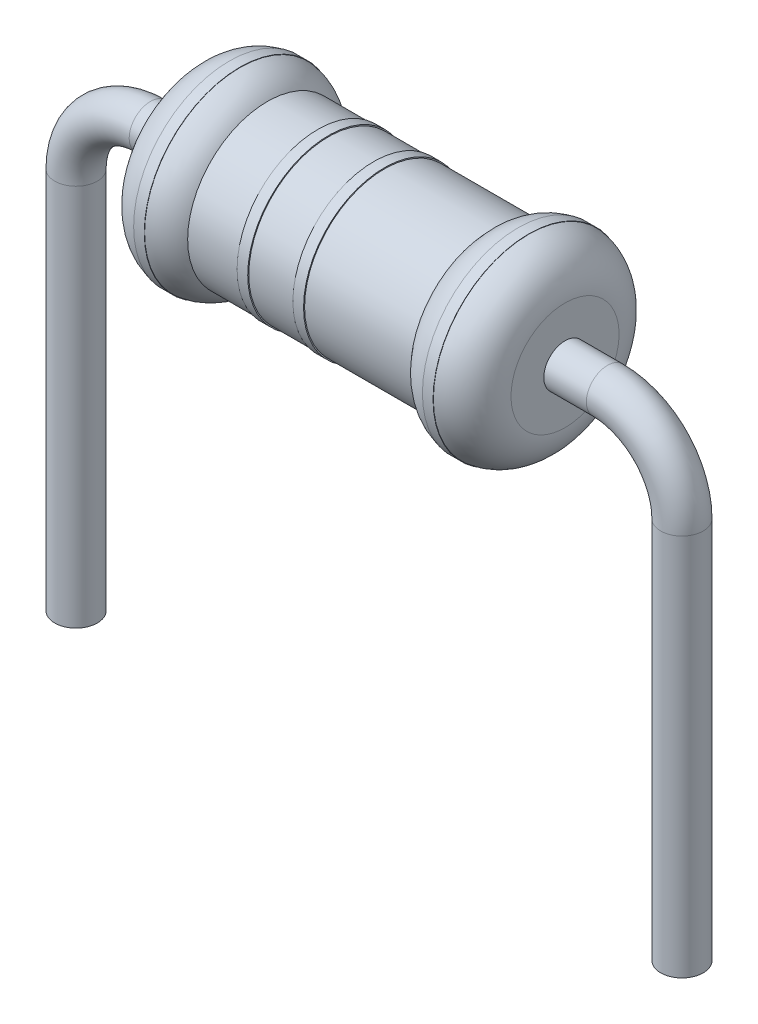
ISO-10303-21;
HEADER;
FILE_DESCRIPTION(('STEP AP214'),'2;1');
FILE_NAME('part.step','',(''),(''),'','','');
FILE_SCHEMA(('AUTOMOTIVE_DESIGN { 1 0 10303 214 1 1 1 1 }'));
ENDSEC;
DATA;
#1=APPLICATION_CONTEXT('core data for automotive mechanical design processes');
#2=APPLICATION_PROTOCOL_DEFINITION('international standard','automotive_design',2000,#1);
#3=PRODUCT_CONTEXT('',#1,'mechanical');
#4=PRODUCT('Part','Part','',(#3));
#5=PRODUCT_RELATED_PRODUCT_CATEGORY('part','',(#4));
#6=PRODUCT_DEFINITION_FORMATION('','',#4);
#7=PRODUCT_DEFINITION_CONTEXT('part definition',#1,'design');
#8=PRODUCT_DEFINITION('design','',#6,#7);
#9=PRODUCT_DEFINITION_SHAPE('','',#8);
#10=(LENGTH_UNIT() NAMED_UNIT(*) SI_UNIT(.MILLI.,.METRE.));
#11=(NAMED_UNIT(*) PLANE_ANGLE_UNIT() SI_UNIT($,.RADIAN.));
#12=(NAMED_UNIT(*) SI_UNIT($,.STERADIAN.) SOLID_ANGLE_UNIT());
#13=UNCERTAINTY_MEASURE_WITH_UNIT(LENGTH_MEASURE(1.E-05),#10,'distance_accuracy_value','');
#14=(GEOMETRIC_REPRESENTATION_CONTEXT(3) GLOBAL_UNCERTAINTY_ASSIGNED_CONTEXT((#13)) GLOBAL_UNIT_ASSIGNED_CONTEXT((#10,
#11,#12)) REPRESENTATION_CONTEXT('',''));
#15=CARTESIAN_POINT('',(0.,0.,0.));
#16=DIRECTION('',(0.,0.,1.));
#17=DIRECTION('',(1.,0.,0.));
#18=AXIS2_PLACEMENT_3D('',#15,#16,#17);
#19=CARTESIAN_POINT('',(1.75000000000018,0.,0.));
#20=DIRECTION('',(-1.,0.,0.));
#21=DIRECTION('',(0.,0.,1.));
#22=AXIS2_PLACEMENT_3D('',#19,#20,#21);
#23=PLANE('',#22);
#24=CARTESIAN_POINT('',(1.75000000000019,0.,0.));
#25=DIRECTION('',(-1.,0.,0.));
#26=DIRECTION('',(0.,0.,1.));
#27=AXIS2_PLACEMENT_3D('',#24,#25,#26);
#28=CIRCLE('',#27,0.508257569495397);
#29=CARTESIAN_POINT('',(1.75000000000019,0.,0.508257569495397));
#30=VERTEX_POINT('',#29);
#31=EDGE_CURVE('E37',#30,#30,#28,.T.);
#32=ORIENTED_EDGE('',*,*,#31,.F.);
#33=EDGE_LOOP('',(#32));
#34=FACE_BOUND('',#33,.T.);
#35=CARTESIAN_POINT('',(1.75000000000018,0.,0.));
#36=DIRECTION('',(-1.,0.,0.));
#37=DIRECTION('',(0.,0.,1.));
#38=AXIS2_PLACEMENT_3D('',#35,#36,#37);
#39=CIRCLE('',#38,0.2);
#40=CARTESIAN_POINT('',(1.75000000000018,0.,0.200000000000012));
#41=VERTEX_POINT('',#40);
#42=EDGE_CURVE('E10',#41,#41,#39,.F.);
#43=ORIENTED_EDGE('',*,*,#42,.F.);
#44=EDGE_LOOP('',(#43));
#45=FACE_BOUND('',#44,.T.);
#46=ADVANCED_FACE('F26',(#34,#45),#23,.F.);
#47=CARTESIAN_POINT('',(-1.75000000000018,0.,0.));
#48=DIRECTION('',(1.,0.,0.));
#49=DIRECTION('',(0.,0.,-1.));
#50=AXIS2_PLACEMENT_3D('',#47,#48,#49);
#51=PLANE('',#50);
#52=CARTESIAN_POINT('',(-1.75000000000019,0.,0.));
#53=DIRECTION('',(-1.,0.,0.));
#54=DIRECTION('',(0.,0.,1.));
#55=AXIS2_PLACEMENT_3D('',#52,#53,#54);
#56=CIRCLE('',#55,0.508257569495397);
#57=CARTESIAN_POINT('',(-1.75000000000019,0.,0.508257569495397));
#58=VERTEX_POINT('',#57);
#59=EDGE_CURVE('E56',#58,#58,#56,.T.);
#60=ORIENTED_EDGE('',*,*,#59,.T.);
#61=EDGE_LOOP('',(#60));
#62=FACE_BOUND('',#61,.T.);
#63=CARTESIAN_POINT('',(-1.75000000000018,0.,0.));
#64=DIRECTION('',(-1.,0.,0.));
#65=DIRECTION('',(0.,0.,1.));
#66=AXIS2_PLACEMENT_3D('',#63,#64,#65);
#67=CIRCLE('',#66,0.2);
#68=CARTESIAN_POINT('',(-1.75000000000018,0.,0.2));
#69=VERTEX_POINT('',#68);
#70=EDGE_CURVE('E33',#69,#69,#67,.T.);
#71=ORIENTED_EDGE('',*,*,#70,.F.);
#72=EDGE_LOOP('',(#71));
#73=FACE_BOUND('',#72,.T.);
#74=ADVANCED_FACE('F28',(#62,#73),#51,.F.);
#75=CARTESIAN_POINT('',(1.35825756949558,0.,0.));
#76=DIRECTION('',(-1.,0.,0.));
#77=DIRECTION('',(0.,0.,1.));
#78=AXIS2_PLACEMENT_3D('',#75,#76,#77);
#79=TOROIDAL_SURFACE('',#78,0.508257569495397,0.391742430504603);
#80=CARTESIAN_POINT('',(1.40825756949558,0.,0.));
#81=DIRECTION('',(-1.,0.,0.));
#82=DIRECTION('',(0.,0.,1.));
#83=AXIS2_PLACEMENT_3D('',#80,#81,#82);
#84=CIRCLE('',#83,0.896796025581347);
#85=CARTESIAN_POINT('',(1.40825756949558,0.,0.896796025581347));
#86=VERTEX_POINT('',#85);
#87=EDGE_CURVE('E42',#86,#86,#84,.T.);
#88=ORIENTED_EDGE('',*,*,#87,.F.);
#89=EDGE_LOOP('',(#88));
#90=FACE_BOUND('',#89,.T.);
#91=ORIENTED_EDGE('',*,*,#31,.T.);
#92=EDGE_LOOP('',(#91));
#93=FACE_BOUND('',#92,.T.);
#94=ADVANCED_FACE('F115',(#90,#93),#79,.T.);
#95=CARTESIAN_POINT('',(1.40825756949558,0.896796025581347,0.));
#96=DIRECTION('',(-1.,0.,0.));
#97=DIRECTION('',(0.,0.,1.));
#98=AXIS2_PLACEMENT_3D('',#95,#96,#97);
#99=PLANE('',#98);
#100=CARTESIAN_POINT('',(1.40825756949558,0.,0.));
#101=DIRECTION('',(-1.,0.,0.));
#102=DIRECTION('',(0.,0.,1.));
#103=AXIS2_PLACEMENT_3D('',#100,#101,#102);
#104=CIRCLE('',#103,0.900000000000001);
#105=CARTESIAN_POINT('',(1.40825756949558,0.,0.900000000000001));
#106=VERTEX_POINT('',#105);
#107=EDGE_CURVE('E107',#106,#106,#104,.T.);
#108=ORIENTED_EDGE('',*,*,#107,.F.);
#109=EDGE_LOOP('',(#108));
#110=FACE_BOUND('',#109,.T.);
#111=ORIENTED_EDGE('',*,*,#87,.T.);
#112=EDGE_LOOP('',(#111));
#113=FACE_BOUND('',#112,.T.);
#114=ADVANCED_FACE('F113',(#110,#113),#99,.F.);
#115=CARTESIAN_POINT('',(-9.42004899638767,0.,0.));
#116=DIRECTION('',(-1.,0.,0.));
#117=DIRECTION('',(0.,0.,1.));
#118=AXIS2_PLACEMENT_3D('',#115,#116,#117);
#119=CYLINDRICAL_SURFACE('',#118,0.900000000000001);
#120=CARTESIAN_POINT('',(1.30825756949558,0.,0.));
#121=DIRECTION('',(-1.,0.,0.));
#122=DIRECTION('',(0.,0.,1.));
#123=AXIS2_PLACEMENT_3D('',#120,#121,#122);
#124=CIRCLE('',#123,0.900000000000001);
#125=CARTESIAN_POINT('',(1.30825756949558,0.,0.900000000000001));
#126=VERTEX_POINT('',#125);
#127=EDGE_CURVE('E104',#126,#126,#124,.T.);
#128=ORIENTED_EDGE('',*,*,#127,.F.);
#129=EDGE_LOOP('',(#128));
#130=FACE_BOUND('',#129,.T.);
#131=ORIENTED_EDGE('',*,*,#107,.T.);
#132=EDGE_LOOP('',(#131));
#133=FACE_BOUND('',#132,.T.);
#134=ADVANCED_FACE('F132',(#130,#133),#119,.T.);
#135=CARTESIAN_POINT('',(1.30825756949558,0.896796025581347,0.));
#136=DIRECTION('',(1.,0.,0.));
#137=DIRECTION('',(0.,0.,-1.));
#138=AXIS2_PLACEMENT_3D('',#135,#136,#137);
#139=PLANE('',#138);
#140=CARTESIAN_POINT('',(1.30825756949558,0.,0.));
#141=DIRECTION('',(-1.,0.,0.));
#142=DIRECTION('',(0.,0.,1.));
#143=AXIS2_PLACEMENT_3D('',#140,#141,#142);
#144=CIRCLE('',#143,0.896796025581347);
#145=CARTESIAN_POINT('',(1.30825756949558,0.,0.896796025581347));
#146=VERTEX_POINT('',#145);
#147=EDGE_CURVE('E101',#146,#146,#144,.T.);
#148=ORIENTED_EDGE('',*,*,#147,.F.);
#149=EDGE_LOOP('',(#148));
#150=FACE_BOUND('',#149,.T.);
#151=ORIENTED_EDGE('',*,*,#127,.T.);
#152=EDGE_LOOP('',(#151));
#153=FACE_BOUND('',#152,.T.);
#154=ADVANCED_FACE('F136',(#150,#153),#139,.F.);
#155=CARTESIAN_POINT('',(1.35825756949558,0.,0.));
#156=DIRECTION('',(-1.,0.,0.));
#157=DIRECTION('',(0.,0.,1.));
#158=AXIS2_PLACEMENT_3D('',#155,#156,#157);
#159=TOROIDAL_SURFACE('',#158,0.508257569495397,0.391742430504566);
#160=CARTESIAN_POINT('',(1.04999999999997,0.,0.));
#161=DIRECTION('',(-1.,0.,0.));
#162=DIRECTION('',(0.,0.,1.));
#163=AXIS2_PLACEMENT_3D('',#160,#161,#162);
#164=CIRCLE('',#163,0.750000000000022);
#165=CARTESIAN_POINT('',(1.04999999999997,0.,0.750000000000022));
#166=VERTEX_POINT('',#165);
#167=EDGE_CURVE('E98',#166,#166,#164,.T.);
#168=ORIENTED_EDGE('',*,*,#167,.F.);
#169=EDGE_LOOP('',(#168));
#170=FACE_BOUND('',#169,.T.);
#171=ORIENTED_EDGE('',*,*,#147,.T.);
#172=EDGE_LOOP('',(#171));
#173=FACE_BOUND('',#172,.T.);
#174=ADVANCED_FACE('F140',(#170,#173),#159,.T.);
#175=CARTESIAN_POINT('',(-9.42004899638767,0.,0.));
#176=DIRECTION('',(-1.,0.,0.));
#177=DIRECTION('',(0.,0.,1.));
#178=AXIS2_PLACEMENT_3D('',#175,#176,#177);
#179=CYLINDRICAL_SURFACE('',#178,0.750000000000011);
#180=CARTESIAN_POINT('',(0.0499999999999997,0.,0.));
#181=DIRECTION('',(-1.,0.,0.));
#182=DIRECTION('',(0.,0.,1.));
#183=AXIS2_PLACEMENT_3D('',#180,#181,#182);
#184=CIRCLE('',#183,0.75);
#185=CARTESIAN_POINT('',(0.0499999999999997,0.,0.75));
#186=VERTEX_POINT('',#185);
#187=EDGE_CURVE('E95',#186,#186,#184,.T.);
#188=ORIENTED_EDGE('',*,*,#187,.F.);
#189=EDGE_LOOP('',(#188));
#190=FACE_BOUND('',#189,.T.);
#191=ORIENTED_EDGE('',*,*,#167,.T.);
#192=EDGE_LOOP('',(#191));
#193=FACE_BOUND('',#192,.T.);
#194=ADVANCED_FACE('F144',(#190,#193),#179,.T.);
#195=CARTESIAN_POINT('',(0.05,0.75,0.));
#196=DIRECTION('',(-1.,0.,0.));
#197=DIRECTION('',(0.,0.,1.));
#198=AXIS2_PLACEMENT_3D('',#195,#196,#197);
#199=PLANE('',#198);
#200=CARTESIAN_POINT('',(0.0499999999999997,0.,0.));
#201=DIRECTION('',(-1.,0.,0.));
#202=DIRECTION('',(0.,0.,1.));
#203=AXIS2_PLACEMENT_3D('',#200,#201,#202);
#204=CIRCLE('',#203,0.760000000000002);
#205=CARTESIAN_POINT('',(0.0499999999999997,0.,0.760000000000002));
#206=VERTEX_POINT('',#205);
#207=EDGE_CURVE('E92',#206,#206,#204,.T.);
#208=ORIENTED_EDGE('',*,*,#207,.F.);
#209=EDGE_LOOP('',(#208));
#210=FACE_BOUND('',#209,.T.);
#211=ORIENTED_EDGE('',*,*,#187,.T.);
#212=EDGE_LOOP('',(#211));
#213=FACE_BOUND('',#212,.T.);
#214=ADVANCED_FACE('F148',(#210,#213),#199,.F.);
#215=CARTESIAN_POINT('',(-9.42004899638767,0.,0.));
#216=DIRECTION('',(-1.,0.,0.));
#217=DIRECTION('',(0.,0.,1.));
#218=AXIS2_PLACEMENT_3D('',#215,#216,#217);
#219=CYLINDRICAL_SURFACE('',#218,0.760000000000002);
#220=CARTESIAN_POINT('',(-0.0499999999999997,0.,0.));
#221=DIRECTION('',(-1.,0.,0.));
#222=DIRECTION('',(0.,0.,1.));
#223=AXIS2_PLACEMENT_3D('',#220,#221,#222);
#224=CIRCLE('',#223,0.760000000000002);
#225=CARTESIAN_POINT('',(-0.0499999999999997,0.,0.760000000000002));
#226=VERTEX_POINT('',#225);
#227=EDGE_CURVE('E89',#226,#226,#224,.T.);
#228=ORIENTED_EDGE('',*,*,#227,.F.);
#229=EDGE_LOOP('',(#228));
#230=FACE_BOUND('',#229,.T.);
#231=ORIENTED_EDGE('',*,*,#207,.T.);
#232=EDGE_LOOP('',(#231));
#233=FACE_BOUND('',#232,.T.);
#234=ADVANCED_FACE('F152',(#230,#233),#219,.T.);
#235=CARTESIAN_POINT('',(-0.05,0.75,0.));
#236=DIRECTION('',(1.,0.,0.));
#237=DIRECTION('',(0.,0.,-1.));
#238=AXIS2_PLACEMENT_3D('',#235,#236,#237);
#239=PLANE('',#238);
#240=CARTESIAN_POINT('',(-0.0499999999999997,0.,0.));
#241=DIRECTION('',(-1.,0.,0.));
#242=DIRECTION('',(0.,0.,1.));
#243=AXIS2_PLACEMENT_3D('',#240,#241,#242);
#244=CIRCLE('',#243,0.75);
#245=CARTESIAN_POINT('',(-0.0499999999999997,0.,0.75));
#246=VERTEX_POINT('',#245);
#247=EDGE_CURVE('E86',#246,#246,#244,.T.);
#248=ORIENTED_EDGE('',*,*,#247,.F.);
#249=EDGE_LOOP('',(#248));
#250=FACE_BOUND('',#249,.T.);
#251=ORIENTED_EDGE('',*,*,#227,.T.);
#252=EDGE_LOOP('',(#251));
#253=FACE_BOUND('',#252,.T.);
#254=ADVANCED_FACE('F156',(#250,#253),#239,.F.);
#255=CARTESIAN_POINT('',(-9.42004899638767,0.,0.));
#256=DIRECTION('',(-1.,0.,0.));
#257=DIRECTION('',(0.,0.,1.));
#258=AXIS2_PLACEMENT_3D('',#255,#256,#257);
#259=CYLINDRICAL_SURFACE('',#258,0.750000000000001);
#260=CARTESIAN_POINT('',(-0.474999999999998,0.,0.));
#261=DIRECTION('',(-1.,0.,0.));
#262=DIRECTION('',(0.,0.,1.));
#263=AXIS2_PLACEMENT_3D('',#260,#261,#262);
#264=CIRCLE('',#263,0.750000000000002);
#265=CARTESIAN_POINT('',(-0.474999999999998,0.,0.750000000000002));
#266=VERTEX_POINT('',#265);
#267=EDGE_CURVE('E83',#266,#266,#264,.T.);
#268=ORIENTED_EDGE('',*,*,#267,.F.);
#269=EDGE_LOOP('',(#268));
#270=FACE_BOUND('',#269,.T.);
#271=ORIENTED_EDGE('',*,*,#247,.T.);
#272=EDGE_LOOP('',(#271));
#273=FACE_BOUND('',#272,.T.);
#274=ADVANCED_FACE('F160',(#270,#273),#259,.T.);
#275=CARTESIAN_POINT('',(-0.474999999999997,0.750000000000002,0.));
#276=DIRECTION('',(-1.,0.,0.));
#277=DIRECTION('',(0.,0.,1.));
#278=AXIS2_PLACEMENT_3D('',#275,#276,#277);
#279=PLANE('',#278);
#280=CARTESIAN_POINT('',(-0.474999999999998,0.,0.));
#281=DIRECTION('',(-1.,0.,0.));
#282=DIRECTION('',(0.,0.,1.));
#283=AXIS2_PLACEMENT_3D('',#280,#281,#282);
#284=CIRCLE('',#283,0.760000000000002);
#285=CARTESIAN_POINT('',(-0.474999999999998,0.,0.760000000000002));
#286=VERTEX_POINT('',#285);
#287=EDGE_CURVE('E80',#286,#286,#284,.T.);
#288=ORIENTED_EDGE('',*,*,#287,.F.);
#289=EDGE_LOOP('',(#288));
#290=FACE_BOUND('',#289,.T.);
#291=ORIENTED_EDGE('',*,*,#267,.T.);
#292=EDGE_LOOP('',(#291));
#293=FACE_BOUND('',#292,.T.);
#294=ADVANCED_FACE('F164',(#290,#293),#279,.F.);
#295=CARTESIAN_POINT('',(-9.42004899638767,0.,0.));
#296=DIRECTION('',(-1.,0.,0.));
#297=DIRECTION('',(0.,0.,1.));
#298=AXIS2_PLACEMENT_3D('',#295,#296,#297);
#299=CYLINDRICAL_SURFACE('',#298,0.760000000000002);
#300=CARTESIAN_POINT('',(-0.574999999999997,0.,0.));
#301=DIRECTION('',(-1.,0.,0.));
#302=DIRECTION('',(0.,0.,1.));
#303=AXIS2_PLACEMENT_3D('',#300,#301,#302);
#304=CIRCLE('',#303,0.760000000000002);
#305=CARTESIAN_POINT('',(-0.574999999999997,0.,0.760000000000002));
#306=VERTEX_POINT('',#305);
#307=EDGE_CURVE('E77',#306,#306,#304,.T.);
#308=ORIENTED_EDGE('',*,*,#307,.F.);
#309=EDGE_LOOP('',(#308));
#310=FACE_BOUND('',#309,.T.);
#311=ORIENTED_EDGE('',*,*,#287,.T.);
#312=EDGE_LOOP('',(#311));
#313=FACE_BOUND('',#312,.T.);
#314=ADVANCED_FACE('F168',(#310,#313),#299,.T.);
#315=CARTESIAN_POINT('',(-0.574999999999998,0.750000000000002,0.));
#316=DIRECTION('',(1.,0.,0.));
#317=DIRECTION('',(0.,0.,-1.));
#318=AXIS2_PLACEMENT_3D('',#315,#316,#317);
#319=PLANE('',#318);
#320=CARTESIAN_POINT('',(-0.574999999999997,0.,0.));
#321=DIRECTION('',(-1.,0.,0.));
#322=DIRECTION('',(0.,0.,1.));
#323=AXIS2_PLACEMENT_3D('',#320,#321,#322);
#324=CIRCLE('',#323,0.750000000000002);
#325=CARTESIAN_POINT('',(-0.574999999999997,0.,0.750000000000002));
#326=VERTEX_POINT('',#325);
#327=EDGE_CURVE('E74',#326,#326,#324,.T.);
#328=ORIENTED_EDGE('',*,*,#327,.F.);
#329=EDGE_LOOP('',(#328));
#330=FACE_BOUND('',#329,.T.);
#331=ORIENTED_EDGE('',*,*,#307,.T.);
#332=EDGE_LOOP('',(#331));
#333=FACE_BOUND('',#332,.T.);
#334=ADVANCED_FACE('F172',(#330,#333),#319,.F.);
#335=CARTESIAN_POINT('',(-9.42004899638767,0.,0.));
#336=DIRECTION('',(-1.,0.,0.));
#337=DIRECTION('',(0.,0.,1.));
#338=AXIS2_PLACEMENT_3D('',#335,#336,#337);
#339=CYLINDRICAL_SURFACE('',#338,0.750000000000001);
#340=CARTESIAN_POINT('',(-1.05,0.,0.));
#341=DIRECTION('',(-1.,0.,0.));
#342=DIRECTION('',(0.,0.,1.));
#343=AXIS2_PLACEMENT_3D('',#340,#341,#342);
#344=CIRCLE('',#343,0.75);
#345=CARTESIAN_POINT('',(-1.05,0.,0.75));
#346=VERTEX_POINT('',#345);
#347=EDGE_CURVE('E71',#346,#346,#344,.T.);
#348=ORIENTED_EDGE('',*,*,#347,.F.);
#349=EDGE_LOOP('',(#348));
#350=FACE_BOUND('',#349,.T.);
#351=ORIENTED_EDGE('',*,*,#327,.T.);
#352=EDGE_LOOP('',(#351));
#353=FACE_BOUND('',#352,.T.);
#354=ADVANCED_FACE('F176',(#350,#353),#339,.T.);
#355=CARTESIAN_POINT('',(-1.35825756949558,0.,0.));
#356=DIRECTION('',(-1.,0.,0.));
#357=DIRECTION('',(0.,0.,1.));
#358=AXIS2_PLACEMENT_3D('',#355,#356,#357);
#359=TOROIDAL_SURFACE('',#358,0.508257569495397,0.391742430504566);
#360=CARTESIAN_POINT('',(-1.30825756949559,0.,0.));
#361=DIRECTION('',(-1.,0.,0.));
#362=DIRECTION('',(0.,0.,1.));
#363=AXIS2_PLACEMENT_3D('',#360,#361,#362);
#364=CIRCLE('',#363,0.896796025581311);
#365=CARTESIAN_POINT('',(-1.30825756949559,0.,0.896796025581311));
#366=VERTEX_POINT('',#365);
#367=EDGE_CURVE('E68',#366,#366,#364,.T.);
#368=ORIENTED_EDGE('',*,*,#367,.F.);
#369=EDGE_LOOP('',(#368));
#370=FACE_BOUND('',#369,.T.);
#371=ORIENTED_EDGE('',*,*,#347,.T.);
#372=EDGE_LOOP('',(#371));
#373=FACE_BOUND('',#372,.T.);
#374=ADVANCED_FACE('F180',(#370,#373),#359,.T.);
#375=CARTESIAN_POINT('',(-1.30825756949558,0.896796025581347,0.));
#376=DIRECTION('',(-1.,0.,0.));
#377=DIRECTION('',(0.,0.,1.));
#378=AXIS2_PLACEMENT_3D('',#375,#376,#377);
#379=PLANE('',#378);
#380=CARTESIAN_POINT('',(-1.30825756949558,0.,0.));
#381=DIRECTION('',(-1.,0.,0.));
#382=DIRECTION('',(0.,0.,1.));
#383=AXIS2_PLACEMENT_3D('',#380,#381,#382);
#384=CIRCLE('',#383,0.900000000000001);
#385=CARTESIAN_POINT('',(-1.30825756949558,0.,0.900000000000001));
#386=VERTEX_POINT('',#385);
#387=EDGE_CURVE('E65',#386,#386,#384,.T.);
#388=ORIENTED_EDGE('',*,*,#387,.F.);
#389=EDGE_LOOP('',(#388));
#390=FACE_BOUND('',#389,.T.);
#391=ORIENTED_EDGE('',*,*,#367,.T.);
#392=EDGE_LOOP('',(#391));
#393=FACE_BOUND('',#392,.T.);
#394=ADVANCED_FACE('F184',(#390,#393),#379,.F.);
#395=CARTESIAN_POINT('',(-9.42004899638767,0.,0.));
#396=DIRECTION('',(-1.,0.,0.));
#397=DIRECTION('',(0.,0.,1.));
#398=AXIS2_PLACEMENT_3D('',#395,#396,#397);
#399=CYLINDRICAL_SURFACE('',#398,0.900000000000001);
#400=CARTESIAN_POINT('',(-1.40825756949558,0.,0.));
#401=DIRECTION('',(-1.,0.,0.));
#402=DIRECTION('',(0.,0.,1.));
#403=AXIS2_PLACEMENT_3D('',#400,#401,#402);
#404=CIRCLE('',#403,0.900000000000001);
#405=CARTESIAN_POINT('',(-1.40825756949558,0.,0.900000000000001));
#406=VERTEX_POINT('',#405);
#407=EDGE_CURVE('E62',#406,#406,#404,.T.);
#408=ORIENTED_EDGE('',*,*,#407,.F.);
#409=EDGE_LOOP('',(#408));
#410=FACE_BOUND('',#409,.T.);
#411=ORIENTED_EDGE('',*,*,#387,.T.);
#412=EDGE_LOOP('',(#411));
#413=FACE_BOUND('',#412,.T.);
#414=ADVANCED_FACE('F188',(#410,#413),#399,.T.);
#415=CARTESIAN_POINT('',(-1.40825756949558,0.896796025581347,0.));
#416=DIRECTION('',(1.,0.,0.));
#417=DIRECTION('',(0.,0.,-1.));
#418=AXIS2_PLACEMENT_3D('',#415,#416,#417);
#419=PLANE('',#418);
#420=CARTESIAN_POINT('',(-1.40825756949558,0.,0.));
#421=DIRECTION('',(-1.,0.,0.));
#422=DIRECTION('',(0.,0.,1.));
#423=AXIS2_PLACEMENT_3D('',#420,#421,#422);
#424=CIRCLE('',#423,0.896796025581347);
#425=CARTESIAN_POINT('',(-1.40825756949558,0.,0.896796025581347));
#426=VERTEX_POINT('',#425);
#427=EDGE_CURVE('E59',#426,#426,#424,.T.);
#428=ORIENTED_EDGE('',*,*,#427,.F.);
#429=EDGE_LOOP('',(#428));
#430=FACE_BOUND('',#429,.T.);
#431=ORIENTED_EDGE('',*,*,#407,.T.);
#432=EDGE_LOOP('',(#431));
#433=FACE_BOUND('',#432,.T.);
#434=ADVANCED_FACE('F192',(#430,#433),#419,.F.);
#435=CARTESIAN_POINT('',(-1.35825756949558,0.,0.));
#436=DIRECTION('',(-1.,0.,0.));
#437=DIRECTION('',(0.,0.,1.));
#438=AXIS2_PLACEMENT_3D('',#435,#436,#437);
#439=TOROIDAL_SURFACE('',#438,0.508257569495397,0.391742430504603);
#440=ORIENTED_EDGE('',*,*,#59,.F.);
#441=EDGE_LOOP('',(#440));
#442=FACE_BOUND('',#441,.T.);
#443=ORIENTED_EDGE('',*,*,#427,.T.);
#444=EDGE_LOOP('',(#443));
#445=FACE_BOUND('',#444,.T.);
#446=ADVANCED_FACE('F196',(#442,#445),#439,.T.);
#447=CARTESIAN_POINT('',(-2.85,-0.699999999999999,0.));
#448=DIRECTION('',(0.,-1.,0.));
#449=DIRECTION('',(0.,0.,-1.));
#450=AXIS2_PLACEMENT_3D('',#447,#448,#449);
#451=CYLINDRICAL_SURFACE('',#450,0.2);
#452=CARTESIAN_POINT('',(-2.85,-0.699999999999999,0.));
#453=DIRECTION('',(0.,-1.,0.));
#454=DIRECTION('',(0.,0.,1.));
#455=AXIS2_PLACEMENT_3D('',#452,#453,#454);
#456=CIRCLE('',#455,0.2);
#457=CARTESIAN_POINT('',(-3.05,-0.699999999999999,0.));
#458=VERTEX_POINT('',#457);
#459=EDGE_CURVE('E50',#458,#458,#456,.T.);
#460=ORIENTED_EDGE('',*,*,#459,.T.);
#461=EDGE_LOOP('',(#460));
#462=FACE_BOUND('',#461,.T.);
#463=CARTESIAN_POINT('',(-2.85,-4.3,0.));
#464=DIRECTION('',(0.,-1.,0.));
#465=DIRECTION('',(0.,0.,1.));
#466=AXIS2_PLACEMENT_3D('',#463,#464,#465);
#467=CIRCLE('',#466,0.2);
#468=CARTESIAN_POINT('',(-2.85,-4.3,0.2));
#469=VERTEX_POINT('',#468);
#470=EDGE_CURVE('E53',#469,#469,#467,.T.);
#471=ORIENTED_EDGE('',*,*,#470,.F.);
#472=EDGE_LOOP('',(#471));
#473=FACE_BOUND('',#472,.T.);
#474=ADVANCED_FACE('F200',(#462,#473),#451,.T.);
#475=CARTESIAN_POINT('',(-2.15,-0.7,0.));
#476=DIRECTION('',(0.,0.,1.));
#477=DIRECTION('',(1.,0.,0.));
#478=AXIS2_PLACEMENT_3D('',#475,#476,#477);
#479=TOROIDAL_SURFACE('',#478,0.7,0.2);
#480=CARTESIAN_POINT('',(-2.15,0.,0.));
#481=DIRECTION('',(-1.,0.,0.));
#482=DIRECTION('',(0.,0.,1.));
#483=AXIS2_PLACEMENT_3D('',#480,#481,#482);
#484=CIRCLE('',#483,0.2);
#485=CARTESIAN_POINT('',(-2.15,0.2,0.));
#486=VERTEX_POINT('',#485);
#487=EDGE_CURVE('E47',#486,#486,#484,.T.);
#488=CARTESIAN_POINT('',(-2.15,-0.7,0.));
#489=DIRECTION('',(0.,0.,1.));
#490=DIRECTION('',(1.,0.,0.));
#491=AXIS2_PLACEMENT_3D('',#488,#489,#490);
#492=CIRCLE('',#491,0.9);
#493=EDGE_CURVE('',#486,#458,#492,.T.);
#494=ORIENTED_EDGE('',*,*,#487,.T.);
#495=ORIENTED_EDGE('',*,*,#459,.F.);
#496=ORIENTED_EDGE('',*,*,#493,.T.);
#497=ORIENTED_EDGE('',*,*,#493,.F.);
#498=EDGE_LOOP('',(#494,#496,#495,#497));
#499=FACE_BOUND('',#498,.T.);
#500=ADVANCED_FACE('F204',(#499),#479,.T.);
#501=CARTESIAN_POINT('',(-2.15,0.,0.));
#502=DIRECTION('',(1.,0.,0.));
#503=DIRECTION('',(0.,1.,0.));
#504=AXIS2_PLACEMENT_3D('',#501,#502,#503);
#505=CYLINDRICAL_SURFACE('',#504,0.2);
#506=ORIENTED_EDGE('',*,*,#487,.F.);
#507=EDGE_LOOP('',(#506));
#508=FACE_BOUND('',#507,.T.);
#509=ORIENTED_EDGE('',*,*,#70,.T.);
#510=EDGE_LOOP('',(#509));
#511=FACE_BOUND('',#510,.T.);
#512=ADVANCED_FACE('F208',(#508,#511),#505,.T.);
#513=CARTESIAN_POINT('',(-2.85,-4.3,0.));
#514=DIRECTION('',(0.,-1.,0.));
#515=DIRECTION('',(0.,0.,1.));
#516=AXIS2_PLACEMENT_3D('',#513,#514,#515);
#517=PLANE('',#516);
#518=ORIENTED_EDGE('',*,*,#470,.T.);
#519=EDGE_LOOP('',(#518));
#520=FACE_BOUND('',#519,.T.);
#521=ADVANCED_FACE('F212',(#520),#517,.T.);
#522=CARTESIAN_POINT('',(2.85,-0.699999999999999,0.));
#523=DIRECTION('',(0.,-1.,0.));
#524=DIRECTION('',(0.,0.,-1.));
#525=AXIS2_PLACEMENT_3D('',#522,#523,#524);
#526=CYLINDRICAL_SURFACE('',#525,0.2);
#527=CARTESIAN_POINT('',(2.85,-0.699999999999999,0.));
#528=DIRECTION('',(0.,-1.,0.));
#529=DIRECTION('',(0.,0.,-1.));
#530=AXIS2_PLACEMENT_3D('',#527,#528,#529);
#531=CIRCLE('',#530,0.2);
#532=CARTESIAN_POINT('',(3.05,-0.699999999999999,0.));
#533=VERTEX_POINT('',#532);
#534=EDGE_CURVE('E235',#533,#533,#531,.T.);
#535=ORIENTED_EDGE('',*,*,#534,.T.);
#536=EDGE_LOOP('',(#535));
#537=FACE_BOUND('',#536,.T.);
#538=CARTESIAN_POINT('',(2.85,-4.3,0.));
#539=DIRECTION('',(0.,-1.,0.));
#540=DIRECTION('',(0.,0.,-1.));
#541=AXIS2_PLACEMENT_3D('',#538,#539,#540);
#542=CIRCLE('',#541,0.2);
#543=CARTESIAN_POINT('',(2.85,-4.3,-0.19999999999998));
#544=VERTEX_POINT('',#543);
#545=EDGE_CURVE('E45',#544,#544,#542,.T.);
#546=ORIENTED_EDGE('',*,*,#545,.F.);
#547=EDGE_LOOP('',(#546));
#548=FACE_BOUND('',#547,.T.);
#549=ADVANCED_FACE('F215',(#537,#548),#526,.T.);
#550=CARTESIAN_POINT('',(2.15,-0.7,0.));
#551=DIRECTION('',(0.,0.,-1.));
#552=DIRECTION('',(-1.,0.,0.));
#553=AXIS2_PLACEMENT_3D('',#550,#551,#552);
#554=TOROIDAL_SURFACE('',#553,0.7,0.2);
#555=CARTESIAN_POINT('',(2.15,0.,0.));
#556=DIRECTION('',(1.,0.,0.));
#557=DIRECTION('',(0.,0.,-1.));
#558=AXIS2_PLACEMENT_3D('',#555,#556,#557);
#559=CIRCLE('',#558,0.2);
#560=CARTESIAN_POINT('',(2.15,0.2,0.));
#561=VERTEX_POINT('',#560);
#562=EDGE_CURVE('E237',#561,#561,#559,.T.);
#563=CARTESIAN_POINT('',(2.15,-0.7,0.));
#564=DIRECTION('',(0.,0.,-1.));
#565=DIRECTION('',(-1.,0.,0.));
#566=AXIS2_PLACEMENT_3D('',#563,#564,#565);
#567=CIRCLE('',#566,0.9);
#568=EDGE_CURVE('',#561,#533,#567,.T.);
#569=ORIENTED_EDGE('',*,*,#562,.T.);
#570=ORIENTED_EDGE('',*,*,#534,.F.);
#571=ORIENTED_EDGE('',*,*,#568,.T.);
#572=ORIENTED_EDGE('',*,*,#568,.F.);
#573=EDGE_LOOP('',(#569,#571,#570,#572));
#574=FACE_BOUND('',#573,.T.);
#575=ADVANCED_FACE('F218',(#574),#554,.T.);
#576=CARTESIAN_POINT('',(2.15,0.,0.));
#577=DIRECTION('',(-1.,0.,0.));
#578=DIRECTION('',(0.,0.,1.));
#579=AXIS2_PLACEMENT_3D('',#576,#577,#578);
#580=CYLINDRICAL_SURFACE('',#579,0.2);
#581=ORIENTED_EDGE('',*,*,#562,.F.);
#582=EDGE_LOOP('',(#581));
#583=FACE_BOUND('',#582,.T.);
#584=ORIENTED_EDGE('',*,*,#42,.T.);
#585=EDGE_LOOP('',(#584));
#586=FACE_BOUND('',#585,.T.);
#587=ADVANCED_FACE('F222',(#583,#586),#580,.T.);
#588=CARTESIAN_POINT('',(2.85,-4.3,0.));
#589=DIRECTION('',(0.,-1.,0.));
#590=DIRECTION('',(0.,0.,-1.));
#591=AXIS2_PLACEMENT_3D('',#588,#589,#590);
#592=PLANE('',#591);
#593=ORIENTED_EDGE('',*,*,#545,.T.);
#594=EDGE_LOOP('',(#593));
#595=FACE_BOUND('',#594,.T.);
#596=ADVANCED_FACE('F226',(#595),#592,.T.);
#597=CLOSED_SHELL('',(#46,#74,#94,#114,#134,#154,#174,#194,#214,#234,#254,#274,#294,#314,#334,
#354,#374,#394,#414,#434,#446,#474,#500,#512,#521,#549,#575,#587,#596));
#598=MANIFOLD_SOLID_BREP('B2',#597);
#599=ADVANCED_BREP_SHAPE_REPRESENTATION('',(#18,#598),#14);
#600=SHAPE_DEFINITION_REPRESENTATION(#9,#599);
ENDSEC;
END-ISO-10303-21;
